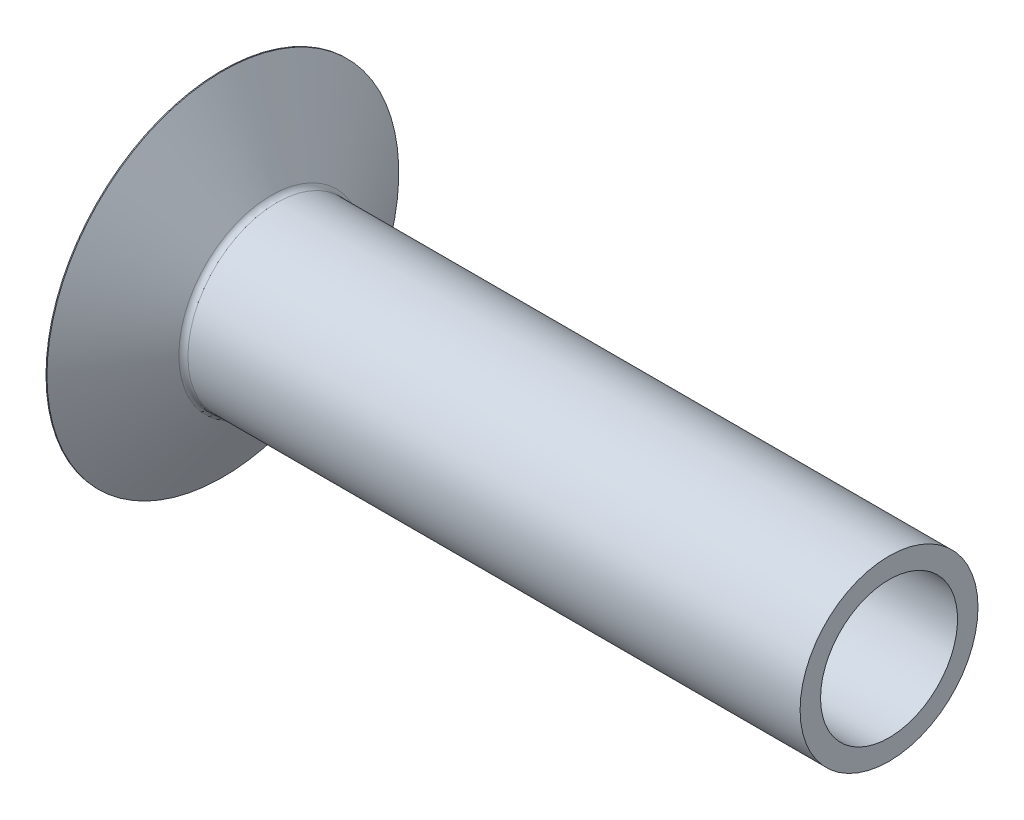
ISO-10303-21;
HEADER;
FILE_DESCRIPTION(('STEP AP214'),'2;1');
FILE_NAME('part.step','',(''),(''),'','','');
FILE_SCHEMA(('AUTOMOTIVE_DESIGN { 1 0 10303 214 1 1 1 1 }'));
ENDSEC;
DATA;
#1=APPLICATION_CONTEXT('core data for automotive mechanical design processes');
#2=APPLICATION_PROTOCOL_DEFINITION('international standard','automotive_design',2000,#1);
#3=PRODUCT_CONTEXT('',#1,'mechanical');
#4=PRODUCT('Part','Part','',(#3));
#5=PRODUCT_RELATED_PRODUCT_CATEGORY('part','',(#4));
#6=PRODUCT_DEFINITION_FORMATION('','',#4);
#7=PRODUCT_DEFINITION_CONTEXT('part definition',#1,'design');
#8=PRODUCT_DEFINITION('design','',#6,#7);
#9=PRODUCT_DEFINITION_SHAPE('','',#8);
#10=(LENGTH_UNIT() NAMED_UNIT(*) SI_UNIT(.MILLI.,.METRE.));
#11=(NAMED_UNIT(*) PLANE_ANGLE_UNIT() SI_UNIT($,.RADIAN.));
#12=(NAMED_UNIT(*) SI_UNIT($,.STERADIAN.) SOLID_ANGLE_UNIT());
#13=UNCERTAINTY_MEASURE_WITH_UNIT(LENGTH_MEASURE(1.E-05),#10,'distance_accuracy_value','');
#14=(GEOMETRIC_REPRESENTATION_CONTEXT(3) GLOBAL_UNCERTAINTY_ASSIGNED_CONTEXT((#13)) GLOBAL_UNIT_ASSIGNED_CONTEXT((#10,
#11,#12)) REPRESENTATION_CONTEXT('',''));
#15=CARTESIAN_POINT('',(0.,0.,0.));
#16=DIRECTION('',(0.,0.,1.));
#17=DIRECTION('',(1.,0.,0.));
#18=AXIS2_PLACEMENT_3D('',#15,#16,#17);
#19=CARTESIAN_POINT('',(30.,0.,0.));
#20=DIRECTION('',(-1.,0.,0.));
#21=DIRECTION('',(0.,0.,1.));
#22=AXIS2_PLACEMENT_3D('',#19,#20,#21);
#23=PLANE('',#22);
#24=CARTESIAN_POINT('',(30.,0.,0.));
#25=DIRECTION('',(-1.,0.,0.));
#26=DIRECTION('',(0.,0.,1.));
#27=AXIS2_PLACEMENT_3D('',#24,#25,#26);
#28=CIRCLE('',#27,4.);
#29=CARTESIAN_POINT('',(30.,0.,4.));
#30=VERTEX_POINT('',#29);
#31=EDGE_CURVE('E52',#30,#30,#28,.T.);
#32=ORIENTED_EDGE('',*,*,#31,.F.);
#33=EDGE_LOOP('',(#32));
#34=FACE_BOUND('',#33,.T.);
#35=CARTESIAN_POINT('',(30.,0.,0.));
#36=DIRECTION('',(-1.,0.,0.));
#37=DIRECTION('',(0.,0.,1.));
#38=AXIS2_PLACEMENT_3D('',#35,#36,#37);
#39=CIRCLE('',#38,3.08);
#40=CARTESIAN_POINT('',(30.,0.,3.08));
#41=VERTEX_POINT('',#40);
#42=EDGE_CURVE('E53',#41,#41,#39,.T.);
#43=ORIENTED_EDGE('',*,*,#42,.T.);
#44=EDGE_LOOP('',(#43));
#45=FACE_BOUND('',#44,.T.);
#46=ADVANCED_FACE('F32',(#34,#45),#23,.F.);
#47=CARTESIAN_POINT('',(0.,7.91,0.));
#48=DIRECTION('',(1.,0.,0.));
#49=DIRECTION('',(0.,0.,-1.));
#50=AXIS2_PLACEMENT_3D('',#47,#48,#49);
#51=PLANE('',#50);
#52=CARTESIAN_POINT('',(0.,0.,0.));
#53=DIRECTION('',(-1.,0.,0.));
#54=DIRECTION('',(0.,0.,1.));
#55=AXIS2_PLACEMENT_3D('',#52,#53,#54);
#56=CIRCLE('',#55,7.91);
#57=CARTESIAN_POINT('',(0.,0.,7.91));
#58=VERTEX_POINT('',#57);
#59=EDGE_CURVE('E11',#58,#58,#56,.T.);
#60=ORIENTED_EDGE('',*,*,#59,.T.);
#61=EDGE_LOOP('',(#60));
#62=FACE_BOUND('',#61,.T.);
#63=ADVANCED_FACE('F34',(#62),#51,.F.);
#64=CARTESIAN_POINT('',(-55.4117318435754,0.,0.));
#65=DIRECTION('',(-1.,0.,0.));
#66=DIRECTION('',(0.,0.,1.));
#67=AXIS2_PLACEMENT_3D('',#64,#65,#66);
#68=CYLINDRICAL_SURFACE('',#67,7.91);
#69=ORIENTED_EDGE('',*,*,#59,.F.);
#70=EDGE_LOOP('',(#69));
#71=FACE_BOUND('',#70,.T.);
#72=CARTESIAN_POINT('',(0.0425604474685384,0.,0.));
#73=DIRECTION('',(-1.,0.,0.));
#74=DIRECTION('',(0.,0.,1.));
#75=AXIS2_PLACEMENT_3D('',#72,#73,#74);
#76=CIRCLE('',#75,7.91);
#77=CARTESIAN_POINT('',(0.0425604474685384,0.,7.91));
#78=VERTEX_POINT('',#77);
#79=EDGE_CURVE('E39',#78,#78,#76,.T.);
#80=ORIENTED_EDGE('',*,*,#79,.T.);
#81=EDGE_LOOP('',(#80));
#82=FACE_BOUND('',#81,.T.);
#83=ADVANCED_FACE('F68',(#71,#82),#68,.T.);
#84=CARTESIAN_POINT('',(2.21339745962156,0.,0.));
#85=DIRECTION('',(-1.,0.,0.));
#86=DIRECTION('',(0.,0.,1.));
#87=AXIS2_PLACEMENT_3D('',#84,#85,#86);
#88=CONICAL_SURFACE('',#87,4.15,1.04719755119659);
#89=ORIENTED_EDGE('',*,*,#79,.F.);
#90=EDGE_LOOP('',(#89));
#91=FACE_BOUND('',#90,.T.);
#92=CARTESIAN_POINT('',(2.21339745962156,0.,0.));
#93=DIRECTION('',(-1.,0.,0.));
#94=DIRECTION('',(0.,0.,1.));
#95=AXIS2_PLACEMENT_3D('',#92,#93,#94);
#96=CIRCLE('',#95,4.15);
#97=CARTESIAN_POINT('',(2.21339745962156,0.,4.15));
#98=VERTEX_POINT('',#97);
#99=EDGE_CURVE('E63',#98,#98,#96,.T.);
#100=ORIENTED_EDGE('',*,*,#99,.T.);
#101=EDGE_LOOP('',(#100));
#102=FACE_BOUND('',#101,.T.);
#103=ADVANCED_FACE('F70',(#91,#102),#88,.T.);
#104=CARTESIAN_POINT('',(2.47320508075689,0.,0.));
#105=DIRECTION('',(-1.,0.,0.));
#106=DIRECTION('',(0.,0.,1.));
#107=AXIS2_PLACEMENT_3D('',#104,#105,#106);
#108=TOROIDAL_SURFACE('',#107,4.3,0.3);
#109=ORIENTED_EDGE('',*,*,#99,.F.);
#110=EDGE_LOOP('',(#109));
#111=FACE_BOUND('',#110,.T.);
#112=CARTESIAN_POINT('',(2.47320508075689,0.,0.));
#113=DIRECTION('',(-1.,0.,0.));
#114=DIRECTION('',(0.,0.,1.));
#115=AXIS2_PLACEMENT_3D('',#112,#113,#114);
#116=CIRCLE('',#115,4.);
#117=CARTESIAN_POINT('',(2.47320508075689,0.,4.));
#118=VERTEX_POINT('',#117);
#119=EDGE_CURVE('E56',#118,#118,#116,.T.);
#120=ORIENTED_EDGE('',*,*,#119,.T.);
#121=EDGE_LOOP('',(#120));
#122=FACE_BOUND('',#121,.T.);
#123=ADVANCED_FACE('F73',(#111,#122),#108,.F.);
#124=CARTESIAN_POINT('',(-55.4117318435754,0.,0.));
#125=DIRECTION('',(-1.,0.,0.));
#126=DIRECTION('',(0.,0.,1.));
#127=AXIS2_PLACEMENT_3D('',#124,#125,#126);
#128=CYLINDRICAL_SURFACE('',#127,4.);
#129=ORIENTED_EDGE('',*,*,#119,.F.);
#130=EDGE_LOOP('',(#129));
#131=FACE_BOUND('',#130,.T.);
#132=ORIENTED_EDGE('',*,*,#31,.T.);
#133=EDGE_LOOP('',(#132));
#134=FACE_BOUND('',#133,.T.);
#135=ADVANCED_FACE('F46',(#131,#134),#128,.T.);
#136=CARTESIAN_POINT('',(21.65,0.,0.));
#137=DIRECTION('',(1.,0.,0.));
#138=DIRECTION('',(0.,0.,-1.));
#139=AXIS2_PLACEMENT_3D('',#136,#137,#138);
#140=CONICAL_SURFACE('',#139,3.08,1.04719755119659);
#141=CARTESIAN_POINT('',(19.8717611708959,0.,0.));
#142=VERTEX_POINT('',#141);
#143=VERTEX_LOOP('',#142);
#144=FACE_BOUND('',#143,.T.);
#145=CARTESIAN_POINT('',(21.65,0.,0.));
#146=DIRECTION('',(-1.,0.,0.));
#147=DIRECTION('',(0.,0.,1.));
#148=AXIS2_PLACEMENT_3D('',#145,#146,#147);
#149=CIRCLE('',#148,3.08);
#150=CARTESIAN_POINT('',(21.65,0.,3.08));
#151=VERTEX_POINT('',#150);
#152=EDGE_CURVE('E50',#151,#151,#149,.T.);
#153=ORIENTED_EDGE('',*,*,#152,.F.);
#154=EDGE_LOOP('',(#153));
#155=FACE_BOUND('',#154,.T.);
#156=ADVANCED_FACE('F42',(#144,#155),#140,.F.);
#157=CARTESIAN_POINT('',(-6.10800744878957,0.,0.));
#158=DIRECTION('',(-1.,0.,0.));
#159=DIRECTION('',(0.,0.,1.));
#160=AXIS2_PLACEMENT_3D('',#157,#158,#159);
#161=CYLINDRICAL_SURFACE('',#160,3.08);
#162=ORIENTED_EDGE('',*,*,#152,.T.);
#163=EDGE_LOOP('',(#162));
#164=FACE_BOUND('',#163,.T.);
#165=ORIENTED_EDGE('',*,*,#42,.F.);
#166=EDGE_LOOP('',(#165));
#167=FACE_BOUND('',#166,.T.);
#168=ADVANCED_FACE('F45',(#164,#167),#161,.F.);
#169=CLOSED_SHELL('',(#46,#63,#83,#103,#123,#135,#156,#168));
#170=MANIFOLD_SOLID_BREP('B2',#169);
#171=ADVANCED_BREP_SHAPE_REPRESENTATION('',(#18,#170),#14);
#172=SHAPE_DEFINITION_REPRESENTATION(#9,#171);
ENDSEC;
END-ISO-10303-21;
